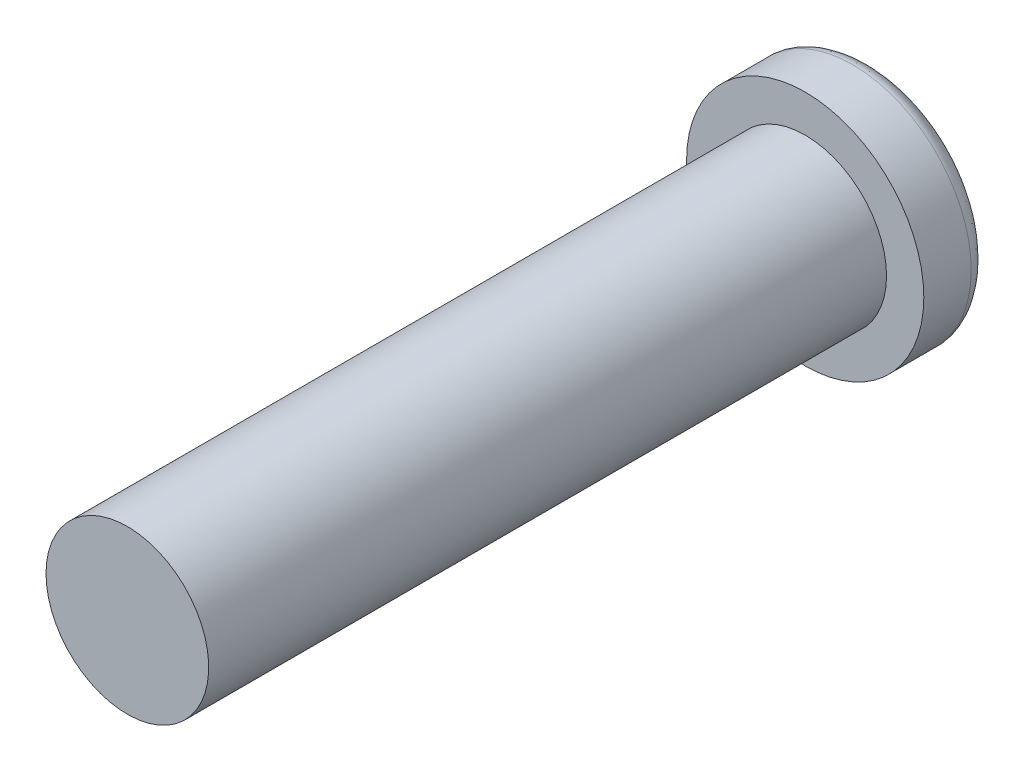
ISO-10303-21;
HEADER;
FILE_DESCRIPTION(('STEP AP214'),'2;1');
FILE_NAME('part.step','',(''),(''),'','','');
FILE_SCHEMA(('AUTOMOTIVE_DESIGN { 1 0 10303 214 1 1 1 1 }'));
ENDSEC;
DATA;
#1=APPLICATION_CONTEXT('core data for automotive mechanical design processes');
#2=APPLICATION_PROTOCOL_DEFINITION('international standard','automotive_design',2000,#1);
#3=PRODUCT_CONTEXT('',#1,'mechanical');
#4=PRODUCT('Part','Part','',(#3));
#5=PRODUCT_RELATED_PRODUCT_CATEGORY('part','',(#4));
#6=PRODUCT_DEFINITION_FORMATION('','',#4);
#7=PRODUCT_DEFINITION_CONTEXT('part definition',#1,'design');
#8=PRODUCT_DEFINITION('design','',#6,#7);
#9=PRODUCT_DEFINITION_SHAPE('','',#8);
#10=(LENGTH_UNIT() NAMED_UNIT(*) SI_UNIT(.MILLI.,.METRE.));
#11=(NAMED_UNIT(*) PLANE_ANGLE_UNIT() SI_UNIT($,.RADIAN.));
#12=(NAMED_UNIT(*) SI_UNIT($,.STERADIAN.) SOLID_ANGLE_UNIT());
#13=UNCERTAINTY_MEASURE_WITH_UNIT(LENGTH_MEASURE(1.E-05),#10,'distance_accuracy_value','');
#14=(GEOMETRIC_REPRESENTATION_CONTEXT(3) GLOBAL_UNCERTAINTY_ASSIGNED_CONTEXT((#13)) GLOBAL_UNIT_ASSIGNED_CONTEXT((#10,
#11,#12)) REPRESENTATION_CONTEXT('',''));
#15=CARTESIAN_POINT('',(0.,0.,0.));
#16=DIRECTION('',(0.,0.,1.));
#17=DIRECTION('',(1.,0.,0.));
#18=AXIS2_PLACEMENT_3D('',#15,#16,#17);
#19=CARTESIAN_POINT('',(0.,0.,-0.889));
#20=DIRECTION('',(0.,0.,1.));
#21=DIRECTION('',(1.,0.,0.));
#22=AXIS2_PLACEMENT_3D('',#19,#20,#21);
#23=CYLINDRICAL_SURFACE('',#22,2.2225);
#24=CARTESIAN_POINT('',(0.,0.,-0.889));
#25=DIRECTION('',(0.,0.,1.));
#26=DIRECTION('',(1.,0.,0.));
#27=AXIS2_PLACEMENT_3D('',#24,#25,#26);
#28=CIRCLE('',#27,2.2225);
#29=CARTESIAN_POINT('',(2.2225,0.,-0.889));
#30=VERTEX_POINT('',#29);
#31=EDGE_CURVE('E185',#30,#30,#28,.T.);
#32=ORIENTED_EDGE('',*,*,#31,.T.);
#33=EDGE_LOOP('',(#32));
#34=FACE_BOUND('',#33,.T.);
#35=CARTESIAN_POINT('',(0.,0.,0.));
#36=DIRECTION('',(0.,0.,1.));
#37=DIRECTION('',(1.,0.,0.));
#38=AXIS2_PLACEMENT_3D('',#35,#36,#37);
#39=CIRCLE('',#38,2.2225);
#40=CARTESIAN_POINT('',(2.2225,0.,0.));
#41=VERTEX_POINT('',#40);
#42=EDGE_CURVE('E182',#41,#41,#39,.T.);
#43=ORIENTED_EDGE('',*,*,#42,.F.);
#44=EDGE_LOOP('',(#43));
#45=FACE_BOUND('',#44,.T.);
#46=ADVANCED_FACE('F17',(#34,#45),#23,.T.);
#47=CARTESIAN_POINT('',(0.,0.,-0.889));
#48=DIRECTION('',(0.,-1.,0.));
#49=DIRECTION('',(1.,0.,0.));
#50=AXIS2_PLACEMENT_3D('',#47,#48,#49);
#51=ELLIPSE('',#50,2.2225,0.762);
#52=TRIMMED_CURVE('',#51,(PARAMETER_VALUE(4.71238898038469)),
(PARAMETER_VALUE(7.85398163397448)),.T.,.PARAMETER.);
#53=CARTESIAN_POINT('',(0.,0.,-0.127));
#54=DIRECTION('',(0.,0.,-1.));
#55=AXIS1_PLACEMENT('',#53,#54);
#56=SURFACE_OF_REVOLUTION('',#52,#55);
#57=CARTESIAN_POINT('',(-0.254,0.254000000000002,-1.64098148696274));
#58=CARTESIAN_POINT('',(-0.313605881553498,0.254000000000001,-1.63860851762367));
#59=CARTESIAN_POINT('',(-0.373181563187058,0.254,-1.635404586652));
#60=CARTESIAN_POINT('',(-0.492232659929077,0.254,-1.62725074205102));
#61=CARTESIAN_POINT('',(-0.551708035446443,0.254,-1.62230025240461));
#62=CARTESIAN_POINT('',(-0.670306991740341,0.254,-1.61058769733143));
#63=CARTESIAN_POINT('',(-0.729431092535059,0.254,-1.60383092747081));
#64=CARTESIAN_POINT('',(-0.847416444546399,0.254,-1.5883670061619));
#65=CARTESIAN_POINT('',(-0.90627774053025,0.254,-1.57966020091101));
#66=CARTESIAN_POINT('',(-0.994725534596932,0.254,-1.56492484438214));
#67=CARTESIAN_POINT('',(-1.02444553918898,0.254,-1.55969061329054));
#68=CARTESIAN_POINT('',(-1.08379804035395,0.254,-1.54863353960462));
#69=CARTESIAN_POINT('',(-1.11343045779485,0.254,-1.54281027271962));
#70=CARTESIAN_POINT('',(-1.143,0.254,-1.53667713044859));
#71=B_SPLINE_CURVE_WITH_KNOTS('',3,(#57,#58,#59,#60,#61,#62,#63,#64,#65,#66,#67,#68,#69,#70),
.UNSPECIFIED.,.F.,.F.,(4,2,2,2,2,2,4),(0.,0.178957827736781,0.357974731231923,0.536472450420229,
0.714938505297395,0.805465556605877,0.896058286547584),.UNSPECIFIED.);
#72=CARTESIAN_POINT('',(-0.254,0.254,-1.64098148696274));
#73=VERTEX_POINT('',#72);
#74=CARTESIAN_POINT('',(-1.143,0.254,-1.53667713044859));
#75=VERTEX_POINT('',#74);
#76=EDGE_CURVE('E32',#73,#75,#71,.T.);
#77=ORIENTED_EDGE('',*,*,#76,.T.);
#78=CARTESIAN_POINT('',(-1.143,0.254,-1.53667713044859));
#79=CARTESIAN_POINT('',(-1.143,0.169333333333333,-1.54056278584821));
#80=CARTESIAN_POINT('',(-1.143,0.0846666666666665,-1.54250561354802));
#81=CARTESIAN_POINT('',(-1.143,-0.0846666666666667,-1.54250561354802));
#82=CARTESIAN_POINT('',(-1.143,-0.169333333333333,-1.54056278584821));
#83=CARTESIAN_POINT('',(-1.143,-0.254,-1.53667713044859));
#84=B_SPLINE_CURVE_WITH_KNOTS('',3,(#78,#79,#80,#81,#82,#83),.UNSPECIFIED.,.F.,.F.,(4,2,4),(0.,
0.254066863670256,0.508133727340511),.UNSPECIFIED.);
#85=CARTESIAN_POINT('',(-1.143,-0.254,-1.53667713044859));
#86=VERTEX_POINT('',#85);
#87=EDGE_CURVE('E11',#75,#86,#84,.T.);
#88=ORIENTED_EDGE('',*,*,#87,.T.);
#89=CARTESIAN_POINT('',(-1.143,-0.254,-1.53667713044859));
#90=CARTESIAN_POINT('',(-1.0941864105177,-0.254,-1.54679516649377));
#91=CARTESIAN_POINT('',(-1.04520497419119,-0.254,-1.55607894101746));
#92=CARTESIAN_POINT('',(-0.947051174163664,-0.254,-1.57309475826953));
#93=CARTESIAN_POINT('',(-0.897879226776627,-0.254,-1.58082919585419));
#94=CARTESIAN_POINT('',(-0.799369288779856,-0.254,-1.59488918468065));
#95=CARTESIAN_POINT('',(-0.750031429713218,-0.254,-1.60121566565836));
#96=CARTESIAN_POINT('',(-0.651211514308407,-0.254,-1.61255277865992));
#97=CARTESIAN_POINT('',(-0.601729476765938,-0.254,-1.61756357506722));
#98=CARTESIAN_POINT('',(-0.502616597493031,-0.254,-1.62634140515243));
#99=CARTESIAN_POINT('',(-0.452985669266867,-0.254,-1.63010745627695));
#100=CARTESIAN_POINT('',(-0.353577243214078,-0.254,-1.63643822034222));
#101=CARTESIAN_POINT('',(-0.303799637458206,-0.254,-1.63900124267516));
#102=CARTESIAN_POINT('',(-0.254000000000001,-0.254000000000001,-1.64098148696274));
#103=B_SPLINE_CURVE_WITH_KNOTS('',3,(#89,#90,#91,#92,#93,#94,#95,#96,#97,#98,#99,#100,#101,
#102),.UNSPECIFIED.,.F.,.F.,(4,2,2,2,2,2,4),(0.,0.149539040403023,0.298845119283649,
0.448052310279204,0.597240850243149,0.746546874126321,0.896062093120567),.UNSPECIFIED.);
#104=CARTESIAN_POINT('',(-0.254000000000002,-0.254,-1.64098148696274));
#105=VERTEX_POINT('',#104);
#106=EDGE_CURVE('E114',#86,#105,#103,.T.);
#107=ORIENTED_EDGE('',*,*,#106,.T.);
#108=CARTESIAN_POINT('',(-0.254000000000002,-0.254,-1.64098148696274));
#109=CARTESIAN_POINT('',(-0.254000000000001,-0.313605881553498,-1.63860851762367));
#110=CARTESIAN_POINT('',(-0.254,-0.373181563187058,-1.635404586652));
#111=CARTESIAN_POINT('',(-0.254,-0.492232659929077,-1.62725074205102));
#112=CARTESIAN_POINT('',(-0.254,-0.551708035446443,-1.62230025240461));
#113=CARTESIAN_POINT('',(-0.254,-0.670306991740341,-1.61058769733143));
#114=CARTESIAN_POINT('',(-0.254,-0.729431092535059,-1.60383092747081));
#115=CARTESIAN_POINT('',(-0.254,-0.847416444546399,-1.5883670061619));
#116=CARTESIAN_POINT('',(-0.254,-0.90627774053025,-1.57966020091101));
#117=CARTESIAN_POINT('',(-0.254,-0.994725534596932,-1.56492484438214));
#118=CARTESIAN_POINT('',(-0.254,-1.02444553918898,-1.55969061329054));
#119=CARTESIAN_POINT('',(-0.254,-1.08379804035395,-1.54863353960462));
#120=CARTESIAN_POINT('',(-0.254,-1.11343045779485,-1.54281027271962));
#121=CARTESIAN_POINT('',(-0.254,-1.143,-1.53667713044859));
#122=B_SPLINE_CURVE_WITH_KNOTS('',3,(#108,#109,#110,#111,#112,#113,#114,#115,#116,#117,#118,
#119,#120,#121),.UNSPECIFIED.,.F.,.F.,(4,2,2,2,2,2,4),(0.,0.178957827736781,0.357974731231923,
0.536472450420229,0.714938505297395,0.805465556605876,0.896058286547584),.UNSPECIFIED.);
#123=CARTESIAN_POINT('',(-0.254,-1.143,-1.53667713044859));
#124=VERTEX_POINT('',#123);
#125=EDGE_CURVE('E198',#105,#124,#122,.T.);
#126=ORIENTED_EDGE('',*,*,#125,.T.);
#127=CARTESIAN_POINT('',(-0.254,-1.143,-1.53667713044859));
#128=CARTESIAN_POINT('',(-0.169333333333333,-1.143,-1.54056278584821));
#129=CARTESIAN_POINT('',(-0.0846666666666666,-1.143,-1.54250561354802));
#130=CARTESIAN_POINT('',(0.0846666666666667,-1.143,-1.54250561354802));
#131=CARTESIAN_POINT('',(0.169333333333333,-1.143,-1.54056278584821));
#132=CARTESIAN_POINT('',(0.254,-1.143,-1.53667713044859));
#133=B_SPLINE_CURVE_WITH_KNOTS('',3,(#127,#128,#129,#130,#131,#132),.UNSPECIFIED.,.F.,.F.,(4,2,
4),(0.,0.254066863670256,0.508133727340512),.UNSPECIFIED.);
#134=CARTESIAN_POINT('',(0.254,-1.143,-1.53667713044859));
#135=VERTEX_POINT('',#134);
#136=EDGE_CURVE('E329',#124,#135,#133,.T.);
#137=ORIENTED_EDGE('',*,*,#136,.T.);
#138=CARTESIAN_POINT('',(0.254,-1.143,-1.53667713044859));
#139=CARTESIAN_POINT('',(0.254,-1.0941864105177,-1.54679516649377));
#140=CARTESIAN_POINT('',(0.254,-1.04520497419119,-1.55607894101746));
#141=CARTESIAN_POINT('',(0.254,-0.947051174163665,-1.57309475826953));
#142=CARTESIAN_POINT('',(0.254,-0.897879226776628,-1.58082919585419));
#143=CARTESIAN_POINT('',(0.254,-0.799369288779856,-1.59488918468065));
#144=CARTESIAN_POINT('',(0.254,-0.750031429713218,-1.60121566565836));
#145=CARTESIAN_POINT('',(0.254,-0.651211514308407,-1.61255277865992));
#146=CARTESIAN_POINT('',(0.254,-0.601729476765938,-1.61756357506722));
#147=CARTESIAN_POINT('',(0.254,-0.502616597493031,-1.62634140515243));
#148=CARTESIAN_POINT('',(0.254,-0.452985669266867,-1.63010745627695));
#149=CARTESIAN_POINT('',(0.254,-0.353577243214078,-1.63643822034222));
#150=CARTESIAN_POINT('',(0.254,-0.303799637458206,-1.63900124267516));
#151=CARTESIAN_POINT('',(0.254000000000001,-0.254,-1.64098148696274));
#152=B_SPLINE_CURVE_WITH_KNOTS('',3,(#138,#139,#140,#141,#142,#143,#144,#145,#146,#147,#148,
#149,#150,#151),.UNSPECIFIED.,.F.,.F.,(4,2,2,2,2,2,4),(0.,0.149539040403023,0.29884511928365,
0.448052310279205,0.59724085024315,0.746546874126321,0.896062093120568),.UNSPECIFIED.);
#153=CARTESIAN_POINT('',(0.254,-0.254,-1.64098148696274));
#154=VERTEX_POINT('',#153);
#155=EDGE_CURVE('E323',#135,#154,#152,.T.);
#156=ORIENTED_EDGE('',*,*,#155,.T.);
#157=CARTESIAN_POINT('',(0.254,-0.254000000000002,-1.64098148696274));
#158=CARTESIAN_POINT('',(0.313605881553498,-0.254000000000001,-1.63860851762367));
#159=CARTESIAN_POINT('',(0.373181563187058,-0.254,-1.635404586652));
#160=CARTESIAN_POINT('',(0.492232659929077,-0.254,-1.62725074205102));
#161=CARTESIAN_POINT('',(0.551708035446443,-0.254,-1.62230025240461));
#162=CARTESIAN_POINT('',(0.670306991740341,-0.254,-1.61058769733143));
#163=CARTESIAN_POINT('',(0.729431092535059,-0.254,-1.60383092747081));
#164=CARTESIAN_POINT('',(0.847416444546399,-0.254,-1.5883670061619));
#165=CARTESIAN_POINT('',(0.90627774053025,-0.254,-1.57966020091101));
#166=CARTESIAN_POINT('',(0.994725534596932,-0.254,-1.56492484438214));
#167=CARTESIAN_POINT('',(1.02444553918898,-0.254,-1.55969061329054));
#168=CARTESIAN_POINT('',(1.08379804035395,-0.254,-1.54863353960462));
#169=CARTESIAN_POINT('',(1.11343045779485,-0.254,-1.54281027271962));
#170=CARTESIAN_POINT('',(1.143,-0.254,-1.53667713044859));
#171=B_SPLINE_CURVE_WITH_KNOTS('',3,(#157,#158,#159,#160,#161,#162,#163,#164,#165,#166,#167,
#168,#169,#170),.UNSPECIFIED.,.F.,.F.,(4,2,2,2,2,2,4),(0.,0.178957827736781,0.357974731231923,
0.536472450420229,0.714938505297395,0.805465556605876,0.896058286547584),.UNSPECIFIED.);
#172=CARTESIAN_POINT('',(1.143,-0.254,-1.53667713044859));
#173=VERTEX_POINT('',#172);
#174=EDGE_CURVE('E316',#154,#173,#171,.T.);
#175=ORIENTED_EDGE('',*,*,#174,.T.);
#176=CARTESIAN_POINT('',(1.143,-0.254,-1.53667713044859));
#177=CARTESIAN_POINT('',(1.143,-0.169333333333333,-1.54056278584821));
#178=CARTESIAN_POINT('',(1.143,-0.0846666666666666,-1.54250561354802));
#179=CARTESIAN_POINT('',(1.143,0.0846666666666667,-1.54250561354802));
#180=CARTESIAN_POINT('',(1.143,0.169333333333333,-1.54056278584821));
#181=CARTESIAN_POINT('',(1.143,0.254,-1.53667713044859));
#182=B_SPLINE_CURVE_WITH_KNOTS('',3,(#176,#177,#178,#179,#180,#181),.UNSPECIFIED.,.F.,.F.,(4,2,
4),(0.,0.254066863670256,0.508133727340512),.UNSPECIFIED.);
#183=CARTESIAN_POINT('',(1.143,0.254,-1.53667713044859));
#184=VERTEX_POINT('',#183);
#185=EDGE_CURVE('E293',#173,#184,#182,.T.);
#186=ORIENTED_EDGE('',*,*,#185,.T.);
#187=CARTESIAN_POINT('',(1.143,0.254,-1.53667713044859));
#188=CARTESIAN_POINT('',(1.0941864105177,0.254,-1.54679516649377));
#189=CARTESIAN_POINT('',(1.04520497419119,0.254,-1.55607894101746));
#190=CARTESIAN_POINT('',(0.947051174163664,0.254,-1.57309475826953));
#191=CARTESIAN_POINT('',(0.897879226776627,0.254,-1.58082919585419));
#192=CARTESIAN_POINT('',(0.799369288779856,0.254,-1.59488918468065));
#193=CARTESIAN_POINT('',(0.750031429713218,0.254,-1.60121566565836));
#194=CARTESIAN_POINT('',(0.651211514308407,0.254,-1.61255277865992));
#195=CARTESIAN_POINT('',(0.601729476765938,0.254,-1.61756357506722));
#196=CARTESIAN_POINT('',(0.502616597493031,0.254,-1.62634140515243));
#197=CARTESIAN_POINT('',(0.452985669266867,0.254,-1.63010745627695));
#198=CARTESIAN_POINT('',(0.353577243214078,0.254,-1.63643822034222));
#199=CARTESIAN_POINT('',(0.303799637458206,0.254,-1.63900124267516));
#200=CARTESIAN_POINT('',(0.254,0.254000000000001,-1.64098148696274));
#201=B_SPLINE_CURVE_WITH_KNOTS('',3,(#187,#188,#189,#190,#191,#192,#193,#194,#195,#196,#197,
#198,#199,#200),.UNSPECIFIED.,.F.,.F.,(4,2,2,2,2,2,4),(0.,0.149539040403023,0.298845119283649,
0.448052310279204,0.597240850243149,0.746546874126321,0.896062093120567),.UNSPECIFIED.);
#202=CARTESIAN_POINT('',(0.254,0.254,-1.64098148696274));
#203=VERTEX_POINT('',#202);
#204=EDGE_CURVE('E286',#184,#203,#201,.T.);
#205=ORIENTED_EDGE('',*,*,#204,.T.);
#206=CARTESIAN_POINT('',(0.254000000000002,0.254,-1.64098148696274));
#207=CARTESIAN_POINT('',(0.254000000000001,0.313605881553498,-1.63860851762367));
#208=CARTESIAN_POINT('',(0.254,0.373181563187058,-1.635404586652));
#209=CARTESIAN_POINT('',(0.254,0.492232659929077,-1.62725074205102));
#210=CARTESIAN_POINT('',(0.254,0.551708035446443,-1.62230025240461));
#211=CARTESIAN_POINT('',(0.254,0.670306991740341,-1.61058769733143));
#212=CARTESIAN_POINT('',(0.254,0.729431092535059,-1.60383092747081));
#213=CARTESIAN_POINT('',(0.254,0.847416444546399,-1.5883670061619));
#214=CARTESIAN_POINT('',(0.254,0.90627774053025,-1.57966020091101));
#215=CARTESIAN_POINT('',(0.254,0.994725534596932,-1.56492484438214));
#216=CARTESIAN_POINT('',(0.254,1.02444553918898,-1.55969061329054));
#217=CARTESIAN_POINT('',(0.254,1.08379804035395,-1.54863353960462));
#218=CARTESIAN_POINT('',(0.254,1.11343045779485,-1.54281027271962));
#219=CARTESIAN_POINT('',(0.254,1.143,-1.53667713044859));
#220=B_SPLINE_CURVE_WITH_KNOTS('',3,(#206,#207,#208,#209,#210,#211,#212,#213,#214,#215,#216,
#217,#218,#219),.UNSPECIFIED.,.F.,.F.,(4,2,2,2,2,2,4),(0.,0.178957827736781,0.357974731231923,
0.536472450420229,0.714938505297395,0.805465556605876,0.896058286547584),.UNSPECIFIED.);
#221=CARTESIAN_POINT('',(0.254,1.143,-1.53667713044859));
#222=VERTEX_POINT('',#221);
#223=EDGE_CURVE('E279',#203,#222,#220,.T.);
#224=ORIENTED_EDGE('',*,*,#223,.T.);
#225=CARTESIAN_POINT('',(0.254,1.143,-1.53667713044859));
#226=CARTESIAN_POINT('',(0.169333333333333,1.143,-1.54056278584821));
#227=CARTESIAN_POINT('',(0.0846666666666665,1.143,-1.54250561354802));
#228=CARTESIAN_POINT('',(-0.0846666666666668,1.143,-1.54250561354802));
#229=CARTESIAN_POINT('',(-0.169333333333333,1.143,-1.54056278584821));
#230=CARTESIAN_POINT('',(-0.254,1.143,-1.53667713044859));
#231=B_SPLINE_CURVE_WITH_KNOTS('',3,(#225,#226,#227,#228,#229,#230),.UNSPECIFIED.,.F.,.F.,(4,2,
4),(0.,0.254066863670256,0.508133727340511),.UNSPECIFIED.);
#232=CARTESIAN_POINT('',(-0.254,1.143,-1.53667713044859));
#233=VERTEX_POINT('',#232);
#234=EDGE_CURVE('E245',#222,#233,#231,.T.);
#235=ORIENTED_EDGE('',*,*,#234,.T.);
#236=CARTESIAN_POINT('',(-0.254,1.143,-1.53667713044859));
#237=CARTESIAN_POINT('',(-0.254,1.0941864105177,-1.54679516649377));
#238=CARTESIAN_POINT('',(-0.254,1.04520497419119,-1.55607894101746));
#239=CARTESIAN_POINT('',(-0.254,0.947051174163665,-1.57309475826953));
#240=CARTESIAN_POINT('',(-0.254,0.897879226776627,-1.58082919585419));
#241=CARTESIAN_POINT('',(-0.254,0.799369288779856,-1.59488918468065));
#242=CARTESIAN_POINT('',(-0.254,0.750031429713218,-1.60121566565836));
#243=CARTESIAN_POINT('',(-0.254,0.651211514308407,-1.61255277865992));
#244=CARTESIAN_POINT('',(-0.254,0.601729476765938,-1.61756357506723));
#245=CARTESIAN_POINT('',(-0.254,0.502616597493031,-1.62634140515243));
#246=CARTESIAN_POINT('',(-0.254,0.452985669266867,-1.63010745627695));
#247=CARTESIAN_POINT('',(-0.254,0.353577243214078,-1.63643822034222));
#248=CARTESIAN_POINT('',(-0.254,0.303799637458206,-1.63900124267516));
#249=CARTESIAN_POINT('',(-0.254000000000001,0.254,-1.64098148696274));
#250=B_SPLINE_CURVE_WITH_KNOTS('',3,(#236,#237,#238,#239,#240,#241,#242,#243,#244,#245,#246,
#247,#248,#249),.UNSPECIFIED.,.F.,.F.,(4,2,2,2,2,2,4),(0.,0.149539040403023,0.298845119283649,
0.448052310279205,0.597240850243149,0.746546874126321,0.896062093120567),.UNSPECIFIED.);
#251=EDGE_CURVE('E242',#233,#73,#250,.T.);
#252=ORIENTED_EDGE('',*,*,#251,.T.);
#253=EDGE_LOOP('',(#77,#88,#107,#126,#137,#156,#175,#186,#205,#224,#235,#252));
#254=FACE_BOUND('',#253,.T.);
#255=ORIENTED_EDGE('',*,*,#31,.F.);
#256=EDGE_LOOP('',(#255));
#257=FACE_BOUND('',#256,.T.);
#258=ADVANCED_FACE('F19',(#254,#257),#56,.F.);
#259=CARTESIAN_POINT('',(0.,0.,0.));
#260=DIRECTION('',(0.,0.,1.));
#261=DIRECTION('',(1.,0.,0.));
#262=AXIS2_PLACEMENT_3D('',#259,#260,#261);
#263=PLANE('',#262);
#264=CARTESIAN_POINT('',(0.,0.,0.));
#265=DIRECTION('',(0.,0.,1.));
#266=DIRECTION('',(1.,0.,0.));
#267=AXIS2_PLACEMENT_3D('',#264,#265,#266);
#268=CIRCLE('',#267,1.524);
#269=CARTESIAN_POINT('',(1.524,0.,0.));
#270=VERTEX_POINT('',#269);
#271=EDGE_CURVE('E187',#270,#270,#268,.T.);
#272=ORIENTED_EDGE('',*,*,#271,.F.);
#273=EDGE_LOOP('',(#272));
#274=FACE_BOUND('',#273,.T.);
#275=ORIENTED_EDGE('',*,*,#42,.T.);
#276=EDGE_LOOP('',(#275));
#277=FACE_BOUND('',#276,.T.);
#278=ADVANCED_FACE('F221',(#274,#277),#263,.T.);
#279=CARTESIAN_POINT('',(0.,0.,12.7));
#280=DIRECTION('',(0.,0.,-1.));
#281=DIRECTION('',(-1.,0.,0.));
#282=AXIS2_PLACEMENT_3D('',#279,#280,#281);
#283=CYLINDRICAL_SURFACE('',#282,1.524);
#284=CARTESIAN_POINT('',(0.,0.,12.7));
#285=DIRECTION('',(0.,0.,-1.));
#286=DIRECTION('',(-1.,0.,0.));
#287=AXIS2_PLACEMENT_3D('',#284,#285,#286);
#288=CIRCLE('',#287,1.524);
#289=CARTESIAN_POINT('',(-1.524,0.,12.7));
#290=VERTEX_POINT('',#289);
#291=EDGE_CURVE('E160',#290,#290,#288,.T.);
#292=ORIENTED_EDGE('',*,*,#291,.T.);
#293=EDGE_LOOP('',(#292));
#294=FACE_BOUND('',#293,.T.);
#295=ORIENTED_EDGE('',*,*,#271,.T.);
#296=EDGE_LOOP('',(#295));
#297=FACE_BOUND('',#296,.T.);
#298=ADVANCED_FACE('F217',(#294,#297),#283,.T.);
#299=CARTESIAN_POINT('',(0.,0.,12.7));
#300=DIRECTION('',(0.,0.,-1.));
#301=DIRECTION('',(-1.,0.,0.));
#302=AXIS2_PLACEMENT_3D('',#299,#300,#301);
#303=PLANE('',#302);
#304=ORIENTED_EDGE('',*,*,#291,.F.);
#305=EDGE_LOOP('',(#304));
#306=FACE_BOUND('',#305,.T.);
#307=ADVANCED_FACE('F214',(#306),#303,.F.);
#308=CARTESIAN_POINT('',(-1.143,0.254,-2.921));
#309=DIRECTION('',(-1.,0.,0.));
#310=DIRECTION('',(0.,0.,1.));
#311=AXIS2_PLACEMENT_3D('',#308,#309,#310);
#312=PLANE('',#311);
#313=DIRECTION('',(0.,0.,1.));
#314=VECTOR('',#313,1.);
#315=CARTESIAN_POINT('',(-1.143,0.254,-2.921));
#316=LINE('',#315,#314);
#317=CARTESIAN_POINT('',(-1.143,0.254,0.));
#318=VERTEX_POINT('',#317);
#319=EDGE_CURVE('E130',#75,#318,#316,.T.);
#320=ORIENTED_EDGE('',*,*,#319,.T.);
#321=DIRECTION('',(0.,-1.,0.));
#322=VECTOR('',#321,1.);
#323=CARTESIAN_POINT('',(-1.143,0.254,0.));
#324=LINE('',#323,#322);
#325=CARTESIAN_POINT('',(-1.143,-0.254,0.));
#326=VERTEX_POINT('',#325);
#327=EDGE_CURVE('E123',#318,#326,#324,.T.);
#328=ORIENTED_EDGE('',*,*,#327,.T.);
#329=DIRECTION('',(0.,0.,1.));
#330=VECTOR('',#329,1.);
#331=CARTESIAN_POINT('',(-1.143,-0.254,-2.921));
#332=LINE('',#331,#330);
#333=EDGE_CURVE('E109',#86,#326,#332,.T.);
#334=ORIENTED_EDGE('',*,*,#333,.F.);
#335=ORIENTED_EDGE('',*,*,#87,.F.);
#336=EDGE_LOOP('',(#320,#328,#334,#335));
#337=FACE_BOUND('',#336,.T.);
#338=ADVANCED_FACE('F129',(#337),#312,.F.);
#339=CARTESIAN_POINT('',(-1.143,0.254,-2.921));
#340=DIRECTION('',(0.,1.,0.));
#341=DIRECTION('',(-1.,0.,0.));
#342=AXIS2_PLACEMENT_3D('',#339,#340,#341);
#343=PLANE('',#342);
#344=DIRECTION('',(0.,0.,1.));
#345=VECTOR('',#344,1.);
#346=CARTESIAN_POINT('',(-0.254,0.254,-2.921));
#347=LINE('',#346,#345);
#348=CARTESIAN_POINT('',(-0.254,0.254,0.));
#349=VERTEX_POINT('',#348);
#350=EDGE_CURVE('E161',#73,#349,#347,.T.);
#351=ORIENTED_EDGE('',*,*,#350,.T.);
#352=DIRECTION('',(-1.,0.,0.));
#353=VECTOR('',#352,1.);
#354=CARTESIAN_POINT('',(-1.143,0.254,0.));
#355=LINE('',#354,#353);
#356=EDGE_CURVE('E116',#349,#318,#355,.T.);
#357=ORIENTED_EDGE('',*,*,#356,.T.);
#358=ORIENTED_EDGE('',*,*,#319,.F.);
#359=ORIENTED_EDGE('',*,*,#76,.F.);
#360=EDGE_LOOP('',(#351,#357,#358,#359));
#361=FACE_BOUND('',#360,.T.);
#362=ADVANCED_FACE('F213',(#361),#343,.F.);
#363=CARTESIAN_POINT('',(-0.254,1.143,-2.921));
#364=DIRECTION('',(-1.,0.,0.));
#365=DIRECTION('',(0.,-1.,0.));
#366=AXIS2_PLACEMENT_3D('',#363,#364,#365);
#367=PLANE('',#366);
#368=DIRECTION('',(0.,0.,1.));
#369=VECTOR('',#368,1.);
#370=CARTESIAN_POINT('',(-0.254,1.143,-2.921));
#371=LINE('',#370,#369);
#372=CARTESIAN_POINT('',(-0.254,1.143,0.));
#373=VERTEX_POINT('',#372);
#374=EDGE_CURVE('E163',#233,#373,#371,.T.);
#375=ORIENTED_EDGE('',*,*,#374,.T.);
#376=DIRECTION('',(0.,-1.,0.));
#377=VECTOR('',#376,1.);
#378=CARTESIAN_POINT('',(-0.254,1.143,0.));
#379=LINE('',#378,#377);
#380=EDGE_CURVE('E155',#373,#349,#379,.T.);
#381=ORIENTED_EDGE('',*,*,#380,.T.);
#382=ORIENTED_EDGE('',*,*,#350,.F.);
#383=ORIENTED_EDGE('',*,*,#251,.F.);
#384=EDGE_LOOP('',(#375,#381,#382,#383));
#385=FACE_BOUND('',#384,.T.);
#386=ADVANCED_FACE('F261',(#385),#367,.F.);
#387=CARTESIAN_POINT('',(-0.254,1.143,-2.921));
#388=DIRECTION('',(0.,1.,0.));
#389=DIRECTION('',(0.,0.,1.));
#390=AXIS2_PLACEMENT_3D('',#387,#388,#389);
#391=PLANE('',#390);
#392=DIRECTION('',(0.,0.,1.));
#393=VECTOR('',#392,1.);
#394=CARTESIAN_POINT('',(0.254,1.143,-2.921));
#395=LINE('',#394,#393);
#396=CARTESIAN_POINT('',(0.254,1.143,0.));
#397=VERTEX_POINT('',#396);
#398=EDGE_CURVE('E165',#222,#397,#395,.T.);
#399=ORIENTED_EDGE('',*,*,#398,.T.);
#400=DIRECTION('',(-1.,0.,0.));
#401=VECTOR('',#400,1.);
#402=CARTESIAN_POINT('',(-0.254,1.143,0.));
#403=LINE('',#402,#401);
#404=EDGE_CURVE('E152',#397,#373,#403,.T.);
#405=ORIENTED_EDGE('',*,*,#404,.T.);
#406=ORIENTED_EDGE('',*,*,#374,.F.);
#407=ORIENTED_EDGE('',*,*,#234,.F.);
#408=EDGE_LOOP('',(#399,#405,#406,#407));
#409=FACE_BOUND('',#408,.T.);
#410=ADVANCED_FACE('F265',(#409),#391,.F.);
#411=CARTESIAN_POINT('',(0.254,1.143,-2.921));
#412=DIRECTION('',(1.,0.,0.));
#413=DIRECTION('',(0.,1.,0.));
#414=AXIS2_PLACEMENT_3D('',#411,#412,#413);
#415=PLANE('',#414);
#416=DIRECTION('',(0.,0.,1.));
#417=VECTOR('',#416,1.);
#418=CARTESIAN_POINT('',(0.254,0.254,-2.921));
#419=LINE('',#418,#417);
#420=CARTESIAN_POINT('',(0.254,0.254,0.));
#421=VERTEX_POINT('',#420);
#422=EDGE_CURVE('E167',#203,#421,#419,.T.);
#423=ORIENTED_EDGE('',*,*,#422,.T.);
#424=DIRECTION('',(0.,1.,0.));
#425=VECTOR('',#424,1.);
#426=CARTESIAN_POINT('',(0.254,1.143,0.));
#427=LINE('',#426,#425);
#428=EDGE_CURVE('E149',#421,#397,#427,.T.);
#429=ORIENTED_EDGE('',*,*,#428,.T.);
#430=ORIENTED_EDGE('',*,*,#398,.F.);
#431=ORIENTED_EDGE('',*,*,#223,.F.);
#432=EDGE_LOOP('',(#423,#429,#430,#431));
#433=FACE_BOUND('',#432,.T.);
#434=ADVANCED_FACE('F270',(#433),#415,.F.);
#435=CARTESIAN_POINT('',(0.254,0.254,-2.921));
#436=DIRECTION('',(0.,1.,0.));
#437=DIRECTION('',(0.,0.,1.));
#438=AXIS2_PLACEMENT_3D('',#435,#436,#437);
#439=PLANE('',#438);
#440=DIRECTION('',(0.,0.,1.));
#441=VECTOR('',#440,1.);
#442=CARTESIAN_POINT('',(1.143,0.254,-2.921));
#443=LINE('',#442,#441);
#444=CARTESIAN_POINT('',(1.143,0.254,0.));
#445=VERTEX_POINT('',#444);
#446=EDGE_CURVE('E169',#184,#445,#443,.T.);
#447=ORIENTED_EDGE('',*,*,#446,.T.);
#448=DIRECTION('',(-1.,0.,0.));
#449=VECTOR('',#448,1.);
#450=CARTESIAN_POINT('',(0.254,0.254,0.));
#451=LINE('',#450,#449);
#452=EDGE_CURVE('E146',#445,#421,#451,.T.);
#453=ORIENTED_EDGE('',*,*,#452,.T.);
#454=ORIENTED_EDGE('',*,*,#422,.F.);
#455=ORIENTED_EDGE('',*,*,#204,.F.);
#456=EDGE_LOOP('',(#447,#453,#454,#455));
#457=FACE_BOUND('',#456,.T.);
#458=ADVANCED_FACE('F300',(#457),#439,.F.);
#459=CARTESIAN_POINT('',(1.143,0.254,-2.921));
#460=DIRECTION('',(1.,0.,0.));
#461=DIRECTION('',(0.,0.,-1.));
#462=AXIS2_PLACEMENT_3D('',#459,#460,#461);
#463=PLANE('',#462);
#464=DIRECTION('',(0.,0.,1.));
#465=VECTOR('',#464,1.);
#466=CARTESIAN_POINT('',(1.143,-0.254,-2.921));
#467=LINE('',#466,#465);
#468=CARTESIAN_POINT('',(1.143,-0.254,0.));
#469=VERTEX_POINT('',#468);
#470=EDGE_CURVE('E171',#173,#469,#467,.T.);
#471=ORIENTED_EDGE('',*,*,#470,.T.);
#472=DIRECTION('',(0.,1.,0.));
#473=VECTOR('',#472,1.);
#474=CARTESIAN_POINT('',(1.143,0.254,0.));
#475=LINE('',#474,#473);
#476=EDGE_CURVE('E143',#469,#445,#475,.T.);
#477=ORIENTED_EDGE('',*,*,#476,.T.);
#478=ORIENTED_EDGE('',*,*,#446,.F.);
#479=ORIENTED_EDGE('',*,*,#185,.F.);
#480=EDGE_LOOP('',(#471,#477,#478,#479));
#481=FACE_BOUND('',#480,.T.);
#482=ADVANCED_FACE('F303',(#481),#463,.F.);
#483=CARTESIAN_POINT('',(0.254,-0.254,-2.921));
#484=DIRECTION('',(0.,-1.,0.));
#485=DIRECTION('',(0.,0.,-1.));
#486=AXIS2_PLACEMENT_3D('',#483,#484,#485);
#487=PLANE('',#486);
#488=DIRECTION('',(0.,0.,1.));
#489=VECTOR('',#488,1.);
#490=CARTESIAN_POINT('',(0.254,-0.254,-2.921));
#491=LINE('',#490,#489);
#492=CARTESIAN_POINT('',(0.254,-0.254,0.));
#493=VERTEX_POINT('',#492);
#494=EDGE_CURVE('E173',#154,#493,#491,.T.);
#495=ORIENTED_EDGE('',*,*,#494,.T.);
#496=DIRECTION('',(1.,0.,0.));
#497=VECTOR('',#496,1.);
#498=CARTESIAN_POINT('',(0.254,-0.254,0.));
#499=LINE('',#498,#497);
#500=EDGE_CURVE('E140',#493,#469,#499,.T.);
#501=ORIENTED_EDGE('',*,*,#500,.T.);
#502=ORIENTED_EDGE('',*,*,#470,.F.);
#503=ORIENTED_EDGE('',*,*,#174,.F.);
#504=EDGE_LOOP('',(#495,#501,#502,#503));
#505=FACE_BOUND('',#504,.T.);
#506=ADVANCED_FACE('F308',(#505),#487,.F.);
#507=CARTESIAN_POINT('',(0.254,-0.254,-2.921));
#508=DIRECTION('',(1.,0.,0.));
#509=DIRECTION('',(0.,1.,0.));
#510=AXIS2_PLACEMENT_3D('',#507,#508,#509);
#511=PLANE('',#510);
#512=DIRECTION('',(0.,0.,1.));
#513=VECTOR('',#512,1.);
#514=CARTESIAN_POINT('',(0.254,-1.143,-2.921));
#515=LINE('',#514,#513);
#516=CARTESIAN_POINT('',(0.254,-1.143,0.));
#517=VERTEX_POINT('',#516);
#518=EDGE_CURVE('E175',#135,#517,#515,.T.);
#519=ORIENTED_EDGE('',*,*,#518,.T.);
#520=DIRECTION('',(0.,1.,0.));
#521=VECTOR('',#520,1.);
#522=CARTESIAN_POINT('',(0.254,-0.254,0.));
#523=LINE('',#522,#521);
#524=EDGE_CURVE('E137',#517,#493,#523,.T.);
#525=ORIENTED_EDGE('',*,*,#524,.T.);
#526=ORIENTED_EDGE('',*,*,#494,.F.);
#527=ORIENTED_EDGE('',*,*,#155,.F.);
#528=EDGE_LOOP('',(#519,#525,#526,#527));
#529=FACE_BOUND('',#528,.T.);
#530=ADVANCED_FACE('F313',(#529),#511,.F.);
#531=CARTESIAN_POINT('',(-0.254,-1.143,-2.921));
#532=DIRECTION('',(0.,-1.,0.));
#533=DIRECTION('',(0.,0.,-1.));
#534=AXIS2_PLACEMENT_3D('',#531,#532,#533);
#535=PLANE('',#534);
#536=DIRECTION('',(0.,0.,1.));
#537=VECTOR('',#536,1.);
#538=CARTESIAN_POINT('',(-0.254,-1.143,-2.921));
#539=LINE('',#538,#537);
#540=CARTESIAN_POINT('',(-0.254,-1.143,0.));
#541=VERTEX_POINT('',#540);
#542=EDGE_CURVE('E177',#124,#541,#539,.T.);
#543=ORIENTED_EDGE('',*,*,#542,.T.);
#544=DIRECTION('',(1.,0.,0.));
#545=VECTOR('',#544,1.);
#546=CARTESIAN_POINT('',(-0.254,-1.143,0.));
#547=LINE('',#546,#545);
#548=EDGE_CURVE('E134',#541,#517,#547,.T.);
#549=ORIENTED_EDGE('',*,*,#548,.T.);
#550=ORIENTED_EDGE('',*,*,#518,.F.);
#551=ORIENTED_EDGE('',*,*,#136,.F.);
#552=EDGE_LOOP('',(#543,#549,#550,#551));
#553=FACE_BOUND('',#552,.T.);
#554=ADVANCED_FACE('F335',(#553),#535,.F.);
#555=CARTESIAN_POINT('',(-0.254,-0.254,-2.921));
#556=DIRECTION('',(-1.,0.,0.));
#557=DIRECTION('',(0.,-1.,0.));
#558=AXIS2_PLACEMENT_3D('',#555,#556,#557);
#559=PLANE('',#558);
#560=DIRECTION('',(0.,0.,1.));
#561=VECTOR('',#560,1.);
#562=CARTESIAN_POINT('',(-0.254,-0.254,-2.921));
#563=LINE('',#562,#561);
#564=CARTESIAN_POINT('',(-0.254,-0.254,0.));
#565=VERTEX_POINT('',#564);
#566=EDGE_CURVE('E39',#105,#565,#563,.T.);
#567=ORIENTED_EDGE('',*,*,#566,.T.);
#568=DIRECTION('',(0.,-1.,0.));
#569=VECTOR('',#568,1.);
#570=CARTESIAN_POINT('',(-0.254,-0.254,0.));
#571=LINE('',#570,#569);
#572=EDGE_CURVE('E127',#565,#541,#571,.T.);
#573=ORIENTED_EDGE('',*,*,#572,.T.);
#574=ORIENTED_EDGE('',*,*,#542,.F.);
#575=ORIENTED_EDGE('',*,*,#125,.F.);
#576=EDGE_LOOP('',(#567,#573,#574,#575));
#577=FACE_BOUND('',#576,.T.);
#578=ADVANCED_FACE('F207',(#577),#559,.F.);
#579=CARTESIAN_POINT('',(-1.143,-0.254,-2.921));
#580=DIRECTION('',(0.,-1.,0.));
#581=DIRECTION('',(1.,0.,0.));
#582=AXIS2_PLACEMENT_3D('',#579,#580,#581);
#583=PLANE('',#582);
#584=ORIENTED_EDGE('',*,*,#333,.T.);
#585=DIRECTION('',(1.,0.,0.));
#586=VECTOR('',#585,1.);
#587=CARTESIAN_POINT('',(-1.143,-0.254,0.));
#588=LINE('',#587,#586);
#589=EDGE_CURVE('E112',#326,#565,#588,.T.);
#590=ORIENTED_EDGE('',*,*,#589,.T.);
#591=ORIENTED_EDGE('',*,*,#566,.F.);
#592=ORIENTED_EDGE('',*,*,#106,.F.);
#593=EDGE_LOOP('',(#584,#590,#591,#592));
#594=FACE_BOUND('',#593,.T.);
#595=ADVANCED_FACE('F111',(#594),#583,.F.);
#596=CARTESIAN_POINT('',(-1.143,-1.143,0.));
#597=DIRECTION('',(0.,0.,1.));
#598=DIRECTION('',(1.,0.,0.));
#599=AXIS2_PLACEMENT_3D('',#596,#597,#598);
#600=PLANE('',#599);
#601=ORIENTED_EDGE('',*,*,#327,.F.);
#602=ORIENTED_EDGE('',*,*,#356,.F.);
#603=ORIENTED_EDGE('',*,*,#380,.F.);
#604=ORIENTED_EDGE('',*,*,#404,.F.);
#605=ORIENTED_EDGE('',*,*,#428,.F.);
#606=ORIENTED_EDGE('',*,*,#452,.F.);
#607=ORIENTED_EDGE('',*,*,#476,.F.);
#608=ORIENTED_EDGE('',*,*,#500,.F.);
#609=ORIENTED_EDGE('',*,*,#524,.F.);
#610=ORIENTED_EDGE('',*,*,#548,.F.);
#611=ORIENTED_EDGE('',*,*,#572,.F.);
#612=ORIENTED_EDGE('',*,*,#589,.F.);
#613=EDGE_LOOP('',(#601,#602,#603,#604,#605,#606,#607,#608,#609,#610,#611,#612));
#614=FACE_BOUND('',#613,.T.);
#615=ADVANCED_FACE('F121',(#614),#600,.F.);
#616=CLOSED_SHELL('',(#46,#258,#278,#298,#307,#338,#362,#386,#410,#434,#458,#482,#506,#530,#554,
#578,#595,#615));
#617=MANIFOLD_SOLID_BREP('B1',#616);
#618=ADVANCED_BREP_SHAPE_REPRESENTATION('',(#18,#617),#14);
#619=SHAPE_DEFINITION_REPRESENTATION(#9,#618);
ENDSEC;
END-ISO-10303-21;
